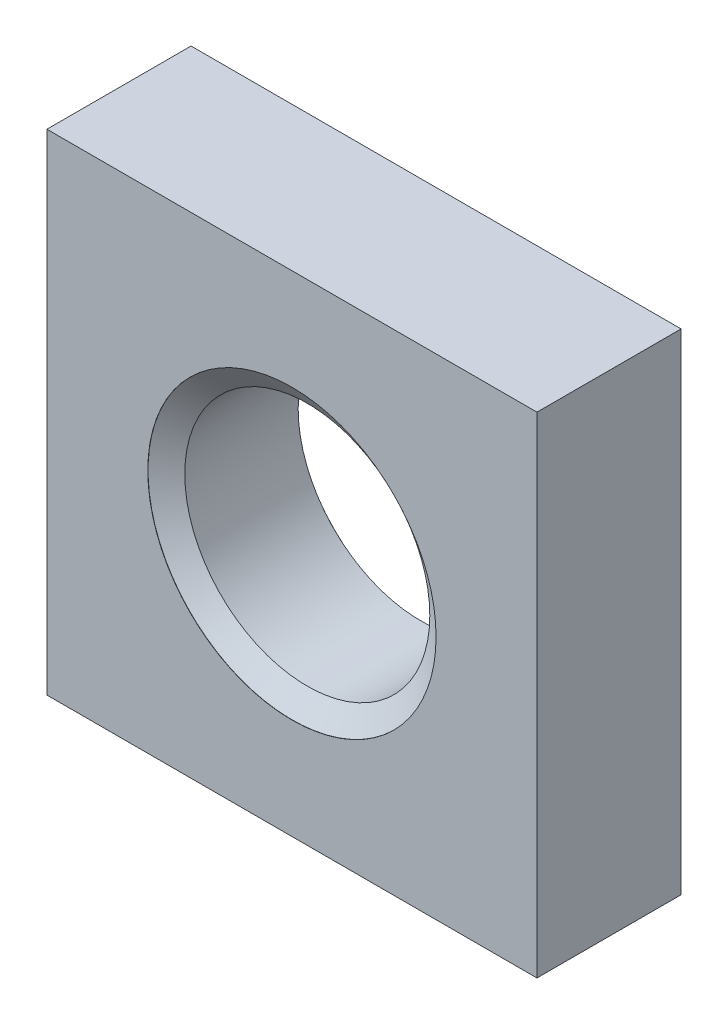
ISO-10303-21;
HEADER;
FILE_DESCRIPTION(('STEP AP214'),'2;1');
FILE_NAME('part.step','',(''),(''),'','','');
FILE_SCHEMA(('AUTOMOTIVE_DESIGN { 1 0 10303 214 1 1 1 1 }'));
ENDSEC;
DATA;
#1=APPLICATION_CONTEXT('core data for automotive mechanical design processes');
#2=APPLICATION_PROTOCOL_DEFINITION('international standard','automotive_design',2000,#1);
#3=PRODUCT_CONTEXT('',#1,'mechanical');
#4=PRODUCT('Part','Part','',(#3));
#5=PRODUCT_RELATED_PRODUCT_CATEGORY('part','',(#4));
#6=PRODUCT_DEFINITION_FORMATION('','',#4);
#7=PRODUCT_DEFINITION_CONTEXT('part definition',#1,'design');
#8=PRODUCT_DEFINITION('design','',#6,#7);
#9=PRODUCT_DEFINITION_SHAPE('','',#8);
#10=(LENGTH_UNIT() NAMED_UNIT(*) SI_UNIT(.MILLI.,.METRE.));
#11=(NAMED_UNIT(*) PLANE_ANGLE_UNIT() SI_UNIT($,.RADIAN.));
#12=(NAMED_UNIT(*) SI_UNIT($,.STERADIAN.) SOLID_ANGLE_UNIT());
#13=UNCERTAINTY_MEASURE_WITH_UNIT(LENGTH_MEASURE(1.E-05),#10,'distance_accuracy_value','');
#14=(GEOMETRIC_REPRESENTATION_CONTEXT(3) GLOBAL_UNCERTAINTY_ASSIGNED_CONTEXT((#13)) GLOBAL_UNIT_ASSIGNED_CONTEXT((#10,
#11,#12)) REPRESENTATION_CONTEXT('',''));
#15=CARTESIAN_POINT('',(0.,0.,0.));
#16=DIRECTION('',(0.,0.,1.));
#17=DIRECTION('',(1.,0.,0.));
#18=AXIS2_PLACEMENT_3D('',#15,#16,#17);
#19=CARTESIAN_POINT('',(0.,0.,-5.));
#20=DIRECTION('',(0.,0.,1.));
#21=DIRECTION('',(1.,0.,0.));
#22=AXIS2_PLACEMENT_3D('',#19,#20,#21);
#23=CYLINDRICAL_SURFACE('',#22,4.25);
#24=CARTESIAN_POINT('',(0.,0.,-0.533155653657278));
#25=DIRECTION('',(0.,0.,1.));
#26=DIRECTION('',(1.,0.,0.));
#27=AXIS2_PLACEMENT_3D('',#24,#25,#26);
#28=CIRCLE('',#27,4.25);
#29=CARTESIAN_POINT('',(4.25,0.,-0.533155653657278));
#30=VERTEX_POINT('',#29);
#31=EDGE_CURVE('E119',#30,#30,#28,.F.);
#32=ORIENTED_EDGE('',*,*,#31,.F.);
#33=EDGE_LOOP('',(#32));
#34=FACE_BOUND('',#33,.T.);
#35=CARTESIAN_POINT('',(0.,0.,-4.46584434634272));
#36=DIRECTION('',(0.,0.,-1.));
#37=DIRECTION('',(-1.,0.,0.));
#38=AXIS2_PLACEMENT_3D('',#35,#36,#37);
#39=CIRCLE('',#38,4.25);
#40=CARTESIAN_POINT('',(-4.25,0.,-4.46584434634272));
#41=VERTEX_POINT('',#40);
#42=EDGE_CURVE('E44',#41,#41,#39,.F.);
#43=ORIENTED_EDGE('',*,*,#42,.F.);
#44=EDGE_LOOP('',(#43));
#45=FACE_BOUND('',#44,.T.);
#46=ADVANCED_FACE('F41',(#34,#45),#23,.F.);
#47=CARTESIAN_POINT('',(-8.5,-8.5,-5.));
#48=DIRECTION('',(-1.,0.,0.));
#49=DIRECTION('',(0.,0.,1.));
#50=AXIS2_PLACEMENT_3D('',#47,#48,#49);
#51=PLANE('',#50);
#52=DIRECTION('',(0.,-1.,0.));
#53=VECTOR('',#52,1.);
#54=CARTESIAN_POINT('',(-8.5,-8.5,0.));
#55=LINE('',#54,#53);
#56=CARTESIAN_POINT('',(-8.5,8.5,0.));
#57=VERTEX_POINT('',#56);
#58=CARTESIAN_POINT('',(-8.5,-8.5,0.));
#59=VERTEX_POINT('',#58);
#60=EDGE_CURVE('E107',#57,#59,#55,.T.);
#61=ORIENTED_EDGE('',*,*,#60,.F.);
#62=DIRECTION('',(0.,0.,1.));
#63=VECTOR('',#62,1.);
#64=CARTESIAN_POINT('',(-8.5,8.5,-5.));
#65=LINE('',#64,#63);
#66=CARTESIAN_POINT('',(-8.5,8.5,-5.));
#67=VERTEX_POINT('',#66);
#68=EDGE_CURVE('E11',#67,#57,#65,.T.);
#69=ORIENTED_EDGE('',*,*,#68,.F.);
#70=DIRECTION('',(0.,-1.,0.));
#71=VECTOR('',#70,1.);
#72=CARTESIAN_POINT('',(-8.5,-8.5,-5.));
#73=LINE('',#72,#71);
#74=CARTESIAN_POINT('',(-8.5,-8.5,-5.));
#75=VERTEX_POINT('',#74);
#76=EDGE_CURVE('E105',#67,#75,#73,.T.);
#77=ORIENTED_EDGE('',*,*,#76,.T.);
#78=DIRECTION('',(0.,0.,1.));
#79=VECTOR('',#78,1.);
#80=CARTESIAN_POINT('',(-8.5,-8.5,-5.));
#81=LINE('',#80,#79);
#82=EDGE_CURVE('E82',#75,#59,#81,.T.);
#83=ORIENTED_EDGE('',*,*,#82,.T.);
#84=EDGE_LOOP('',(#61,#69,#77,#83));
#85=FACE_BOUND('',#84,.T.);
#86=ADVANCED_FACE('F43',(#85),#51,.T.);
#87=CARTESIAN_POINT('',(-8.5,8.5,-5.));
#88=DIRECTION('',(0.,1.,0.));
#89=DIRECTION('',(0.,0.,1.));
#90=AXIS2_PLACEMENT_3D('',#87,#88,#89);
#91=PLANE('',#90);
#92=DIRECTION('',(-1.,0.,0.));
#93=VECTOR('',#92,1.);
#94=CARTESIAN_POINT('',(-8.5,8.5,0.));
#95=LINE('',#94,#93);
#96=CARTESIAN_POINT('',(8.5,8.5,0.));
#97=VERTEX_POINT('',#96);
#98=EDGE_CURVE('E104',#97,#57,#95,.T.);
#99=ORIENTED_EDGE('',*,*,#98,.F.);
#100=DIRECTION('',(0.,0.,1.));
#101=VECTOR('',#100,1.);
#102=CARTESIAN_POINT('',(8.5,8.5,-5.));
#103=LINE('',#102,#101);
#104=CARTESIAN_POINT('',(8.5,8.5,-5.));
#105=VERTEX_POINT('',#104);
#106=EDGE_CURVE('E51',#105,#97,#103,.T.);
#107=ORIENTED_EDGE('',*,*,#106,.F.);
#108=DIRECTION('',(-1.,0.,0.));
#109=VECTOR('',#108,1.);
#110=CARTESIAN_POINT('',(-8.5,8.5,-5.));
#111=LINE('',#110,#109);
#112=EDGE_CURVE('E100',#105,#67,#111,.T.);
#113=ORIENTED_EDGE('',*,*,#112,.T.);
#114=ORIENTED_EDGE('',*,*,#68,.T.);
#115=EDGE_LOOP('',(#99,#107,#113,#114));
#116=FACE_BOUND('',#115,.T.);
#117=ADVANCED_FACE('F152',(#116),#91,.T.);
#118=CARTESIAN_POINT('',(8.5,-8.5,-5.));
#119=DIRECTION('',(1.,0.,0.));
#120=DIRECTION('',(0.,0.,-1.));
#121=AXIS2_PLACEMENT_3D('',#118,#119,#120);
#122=PLANE('',#121);
#123=DIRECTION('',(0.,1.,0.));
#124=VECTOR('',#123,1.);
#125=CARTESIAN_POINT('',(8.5,-8.5,0.));
#126=LINE('',#125,#124);
#127=CARTESIAN_POINT('',(8.5,-8.5,0.));
#128=VERTEX_POINT('',#127);
#129=EDGE_CURVE('E93',#128,#97,#126,.T.);
#130=ORIENTED_EDGE('',*,*,#129,.F.);
#131=DIRECTION('',(0.,0.,1.));
#132=VECTOR('',#131,1.);
#133=CARTESIAN_POINT('',(8.5,-8.5,-5.));
#134=LINE('',#133,#132);
#135=CARTESIAN_POINT('',(8.5,-8.5,-5.));
#136=VERTEX_POINT('',#135);
#137=EDGE_CURVE('E88',#136,#128,#134,.T.);
#138=ORIENTED_EDGE('',*,*,#137,.F.);
#139=DIRECTION('',(0.,1.,0.));
#140=VECTOR('',#139,1.);
#141=CARTESIAN_POINT('',(8.5,-8.5,-5.));
#142=LINE('',#141,#140);
#143=EDGE_CURVE('E91',#136,#105,#142,.T.);
#144=ORIENTED_EDGE('',*,*,#143,.T.);
#145=ORIENTED_EDGE('',*,*,#106,.T.);
#146=EDGE_LOOP('',(#130,#138,#144,#145));
#147=FACE_BOUND('',#146,.T.);
#148=ADVANCED_FACE('F86',(#147),#122,.T.);
#149=CARTESIAN_POINT('',(-8.5,-8.5,-5.));
#150=DIRECTION('',(0.,-1.,0.));
#151=DIRECTION('',(0.,0.,-1.));
#152=AXIS2_PLACEMENT_3D('',#149,#150,#151);
#153=PLANE('',#152);
#154=DIRECTION('',(1.,0.,0.));
#155=VECTOR('',#154,1.);
#156=CARTESIAN_POINT('',(-8.5,-8.5,0.));
#157=LINE('',#156,#155);
#158=EDGE_CURVE('E115',#59,#128,#157,.T.);
#159=ORIENTED_EDGE('',*,*,#158,.F.);
#160=ORIENTED_EDGE('',*,*,#82,.F.);
#161=DIRECTION('',(1.,0.,0.));
#162=VECTOR('',#161,1.);
#163=CARTESIAN_POINT('',(-8.5,-8.5,-5.));
#164=LINE('',#163,#162);
#165=EDGE_CURVE('E96',#75,#136,#164,.T.);
#166=ORIENTED_EDGE('',*,*,#165,.T.);
#167=ORIENTED_EDGE('',*,*,#137,.T.);
#168=EDGE_LOOP('',(#159,#160,#166,#167));
#169=FACE_BOUND('',#168,.T.);
#170=ADVANCED_FACE('F103',(#169),#153,.T.);
#171=CARTESIAN_POINT('',(-8.5,8.5,-5.));
#172=DIRECTION('',(0.,0.,-1.));
#173=DIRECTION('',(-1.,0.,0.));
#174=AXIS2_PLACEMENT_3D('',#171,#172,#173);
#175=PLANE('',#174);
#176=CARTESIAN_POINT('',(0.,0.,-5.));
#177=DIRECTION('',(0.,0.,-1.));
#178=DIRECTION('',(-1.,0.,0.));
#179=AXIS2_PLACEMENT_3D('',#176,#177,#178);
#180=CIRCLE('',#179,5.);
#181=CARTESIAN_POINT('',(-5.,0.,-5.));
#182=VERTEX_POINT('',#181);
#183=EDGE_CURVE('E123',#182,#182,#180,.F.);
#184=ORIENTED_EDGE('',*,*,#183,.T.);
#185=EDGE_LOOP('',(#184));
#186=FACE_BOUND('',#185,.T.);
#187=ORIENTED_EDGE('',*,*,#76,.F.);
#188=ORIENTED_EDGE('',*,*,#112,.F.);
#189=ORIENTED_EDGE('',*,*,#143,.F.);
#190=ORIENTED_EDGE('',*,*,#165,.F.);
#191=EDGE_LOOP('',(#187,#188,#189,#190));
#192=FACE_BOUND('',#191,.T.);
#193=ADVANCED_FACE('F97',(#186,#192),#175,.T.);
#194=CARTESIAN_POINT('',(-8.5,8.5,0.));
#195=DIRECTION('',(0.,0.,-1.));
#196=DIRECTION('',(-1.,0.,0.));
#197=AXIS2_PLACEMENT_3D('',#194,#195,#196);
#198=PLANE('',#197);
#199=CARTESIAN_POINT('',(0.,0.,0.));
#200=DIRECTION('',(0.,0.,-1.));
#201=DIRECTION('',(-1.,0.,0.));
#202=AXIS2_PLACEMENT_3D('',#199,#200,#201);
#203=CIRCLE('',#202,5.);
#204=CARTESIAN_POINT('',(-5.,0.,0.));
#205=VERTEX_POINT('',#204);
#206=EDGE_CURVE('E113',#205,#205,#203,.F.);
#207=ORIENTED_EDGE('',*,*,#206,.F.);
#208=EDGE_LOOP('',(#207));
#209=FACE_BOUND('',#208,.T.);
#210=ORIENTED_EDGE('',*,*,#60,.T.);
#211=ORIENTED_EDGE('',*,*,#158,.T.);
#212=ORIENTED_EDGE('',*,*,#129,.T.);
#213=ORIENTED_EDGE('',*,*,#98,.T.);
#214=EDGE_LOOP('',(#210,#211,#212,#213));
#215=FACE_BOUND('',#214,.T.);
#216=ADVANCED_FACE('F144',(#209,#215),#198,.F.);
#217=CARTESIAN_POINT('',(0.,0.,-25.0375057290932));
#218=DIRECTION('',(0.,0.,1.));
#219=DIRECTION('',(1.,0.,0.));
#220=AXIS2_PLACEMENT_3D('',#217,#218,#219);
#221=CYLINDRICAL_SURFACE('',#220,5.);
#222=CARTESIAN_POINT('',(0.,0.,-0.00799999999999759));
#223=DIRECTION('',(0.,0.,1.));
#224=DIRECTION('',(1.,0.,0.));
#225=AXIS2_PLACEMENT_3D('',#222,#223,#224);
#226=CIRCLE('',#225,5.);
#227=CARTESIAN_POINT('',(5.,0.,-0.00799999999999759));
#228=VERTEX_POINT('',#227);
#229=EDGE_CURVE('E124',#228,#228,#226,.T.);
#230=ORIENTED_EDGE('',*,*,#229,.F.);
#231=EDGE_LOOP('',(#230));
#232=FACE_BOUND('',#231,.T.);
#233=ORIENTED_EDGE('',*,*,#206,.T.);
#234=EDGE_LOOP('',(#233));
#235=FACE_BOUND('',#234,.T.);
#236=ADVANCED_FACE('F142',(#232,#235),#221,.F.);
#237=CARTESIAN_POINT('',(0.,0.,-0.585671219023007));
#238=DIRECTION('',(0.,0.,1.));
#239=DIRECTION('',(1.,0.,0.));
#240=AXIS2_PLACEMENT_3D('',#237,#238,#239);
#241=CONICAL_SURFACE('',#240,4.175,0.959931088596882);
#242=ORIENTED_EDGE('',*,*,#229,.T.);
#243=EDGE_LOOP('',(#242));
#244=FACE_BOUND('',#243,.T.);
#245=ORIENTED_EDGE('',*,*,#31,.T.);
#246=EDGE_LOOP('',(#245));
#247=FACE_BOUND('',#246,.T.);
#248=ADVANCED_FACE('F138',(#244,#247),#241,.F.);
#249=CARTESIAN_POINT('',(0.,0.,-4.991));
#250=DIRECTION('',(0.,0.,-1.));
#251=DIRECTION('',(-1.,0.,0.));
#252=AXIS2_PLACEMENT_3D('',#249,#250,#251);
#253=CONICAL_SURFACE('',#252,5.,0.959931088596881);
#254=CARTESIAN_POINT('',(0.,0.,-4.991));
#255=DIRECTION('',(0.,0.,1.));
#256=DIRECTION('',(1.,0.,0.));
#257=AXIS2_PLACEMENT_3D('',#254,#255,#256);
#258=CIRCLE('',#257,5.);
#259=CARTESIAN_POINT('',(5.,0.,-4.991));
#260=VERTEX_POINT('',#259);
#261=EDGE_CURVE('E126',#260,#260,#258,.T.);
#262=ORIENTED_EDGE('',*,*,#261,.F.);
#263=EDGE_LOOP('',(#262));
#264=FACE_BOUND('',#263,.T.);
#265=ORIENTED_EDGE('',*,*,#42,.T.);
#266=EDGE_LOOP('',(#265));
#267=FACE_BOUND('',#266,.T.);
#268=ADVANCED_FACE('F201',(#264,#267),#253,.F.);
#269=CARTESIAN_POINT('',(0.,0.,-25.0375057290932));
#270=DIRECTION('',(0.,0.,1.));
#271=DIRECTION('',(1.,0.,0.));
#272=AXIS2_PLACEMENT_3D('',#269,#270,#271);
#273=CYLINDRICAL_SURFACE('',#272,5.);
#274=ORIENTED_EDGE('',*,*,#183,.F.);
#275=EDGE_LOOP('',(#274));
#276=FACE_BOUND('',#275,.T.);
#277=ORIENTED_EDGE('',*,*,#261,.T.);
#278=EDGE_LOOP('',(#277));
#279=FACE_BOUND('',#278,.T.);
#280=ADVANCED_FACE('F209',(#276,#279),#273,.F.);
#281=CLOSED_SHELL('',(#46,#86,#117,#148,#170,#193,#216,#236,#248,#268,#280));
#282=MANIFOLD_SOLID_BREP('B2',#281);
#283=ADVANCED_BREP_SHAPE_REPRESENTATION('',(#18,#282),#14);
#284=SHAPE_DEFINITION_REPRESENTATION(#9,#283);
ENDSEC;
END-ISO-10303-21;
